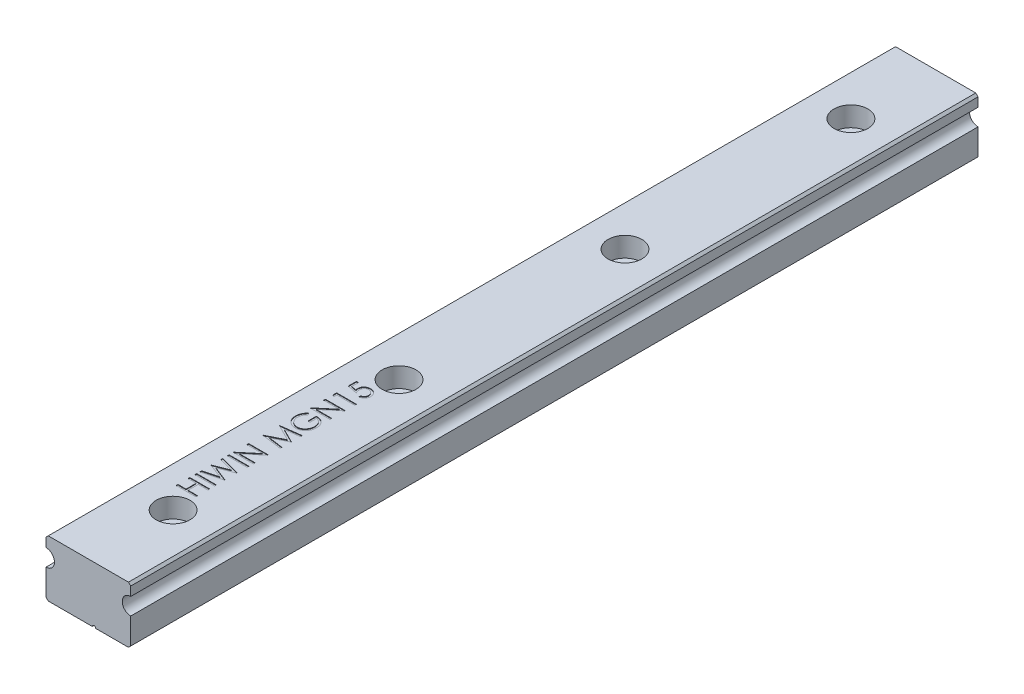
from build123d import *

# Parameters (mm, degrees)
EXTRUDE_1_DEPTH              = 150
HOLE_WIZARD_M3_1_D           = 3.5
HOLE_WIZARD_M3_1_CBORE_D     = 6
HOLE_WIZARD_M3_1_CBORE_DEPTH = 3.5
PATTERN_LINEAR_1_COUNT       = 4
PATTERN_LINEAR_1_PITCH       = 40
SKETCH_6_W                   = 3.5
SKETCH_6_H                   = 0.314102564
CUT_EXTRUDE_1_DEPTH          = 0.1


with BuildPart() as part:
    # Sketch 1 → Extrude 1 (new body)
    with BuildSketch(Plane.XY):
        with BuildLine():
            Line((-7.1, 0), (0.7, 0))
            ThreePointArc((0.7, 0), (1, 0.3), (1.3, 0))
            Line((1.3, 0), (7.1, 0))
            Line((7.1, 0), (7.5, 0.4))
            Line((7.5, 0.4), (7.5, 5))
            ThreePointArc((7.5, 5), (6, 6.5), (7.5, 8))
            Line((7.5, 8), (7.5, 9.6))
            Line((7.5, 9.6), (7.1, 10))
            Line((7.1, 10), (-7.1, 10))
            Line((-7.1, 10), (-7.5, 9.6))
            Line((-7.5, 9.6), (-7.5, 8))
            ThreePointArc((-7.5, 8), (-6, 6.5), (-7.5, 5))
            Line((-7.5, 5), (-7.5, 0.4))
            Line((-7.5, 0.4), (-7.1, 0))
        make_face()
    extrude(amount=-EXTRUDE_1_DEPTH)

    # Hole Wizard M3 _1 (through all)
    with Locations(Plane(origin=(-0.370542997, 10, 7.777563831), x_dir=(-1, 0, 0), z_dir=(0, 1, 0))):
        with Locations((-0.370542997, -22.777563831)):
            hole_wizard_m3_1 = CounterBoreHole(HOLE_WIZARD_M3_1_D / 2, HOLE_WIZARD_M3_1_CBORE_D / 2, HOLE_WIZARD_M3_1_CBORE_DEPTH)

    # Pattern Linear 1: Hole Wizard M3 _1 ×4
    with Locations(*[(0, 0, -i * PATTERN_LINEAR_1_PITCH) for i in range(1, PATTERN_LINEAR_1_COUNT)]):
        add(hole_wizard_m3_1, mode=Mode.SUBTRACT)

    # Sketch 6 → Cut-Extrude 1 (cut)
    with BuildSketch(Plane(origin=(0, 10, 0), x_dir=(1, 0, 0), z_dir=(0, 1, 0))):
        Polygon((-3.5, 19.048076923), (-3.5, 19.362179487), (-2.064102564, 19.362179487), (-2.064102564, 21.157051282), (-3.5, 21.157051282), (-3.5, 21.471153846), (0, 21.471153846), (0, 21.157051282), (-1.705128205, 21.157051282), (-1.705128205, 19.362179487), (0, 19.362179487), (0, 19.048076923), align=None)
        with Locations((-1.75, 22.525641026)):
            Rectangle(SKETCH_6_W, SKETCH_6_H)
        Polygon((-3.5, 23.221153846), (-3.5, 23.545773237), (-0.933193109, 24.230769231), (-3.5, 25.249499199), (-3.5, 25.295072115), (-0.950721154, 26.294871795), (-3.5, 26.983373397), (-3.5, 27.304487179), (0, 26.360777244), (0, 26.315905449), (-2.676883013, 25.262820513), (0, 24.197115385), (0, 24.15224359), align=None)
        with Locations((-1.75, 28.269230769)):
            Rectangle(SKETCH_6_W, SKETCH_6_H)
        Polygon((0, 29.189102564), (-3.5, 29.189102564), (-3.5, 29.255008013), (-0.745292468, 31.567307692), (-3.5, 31.567307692), (-3.5, 31.881410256), (0, 31.881410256), (0, 31.809895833), (-2.748397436, 29.503205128), (0, 29.503205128), align=None)
        Polygon((0, 33.945512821), (-3.5, 34.407552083), (-3.5, 34.452423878), (-0.628205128, 35.897435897), (-3.5, 37.338942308), (-3.5, 37.384515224), (0, 37.849358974), (0, 37.533854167), (-2.518429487, 37.198717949), (0, 35.935296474), (0, 35.864483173), (-2.524038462, 34.596153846), (0, 34.26171875), align=None)
        with BuildLine():
            Line((-2.902644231, 41.842948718), (-2.647435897, 41.573717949))
            add(Edge.make_bspline(
                [(-2.647435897, 41.573717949), (-2.69328212, 41.525008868), (-2.783881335, 41.428752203), (-2.901244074, 41.271552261), (-3.002777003, 41.108196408), (-3.084772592, 40.938420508), (-3.149094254, 40.766676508), (-3.195850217, 40.595917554), (-3.225460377, 40.427249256), (-3.229016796, 40.315084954), (-3.230769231, 40.259815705)],
                knots=[0, 0, 0, 0, 1.089067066, 2.152164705, 3.18986567, 4.218445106, 5.218487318, 6.173592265, 7.100032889, 8, 8, 8, 8], degree=3))
            add(Edge.make_bspline(
                [(-3.230769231, 40.259815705), (-3.230355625, 40.225901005), (-3.229529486, 40.158159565), (-3.218985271, 40.057537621), (-3.203820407, 39.957970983), (-3.181878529, 39.859647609), (-3.15406947, 39.762376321), (-3.119284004, 39.666495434), (-3.078728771, 39.571826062), (-3.031866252, 39.479260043), (-2.980386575, 39.38951931), (-2.923337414, 39.304763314), (-2.862550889, 39.224446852), (-2.796491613, 39.150097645), (-2.725807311, 39.081221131), (-2.651770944, 39.01655043), (-2.572926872, 38.957290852), (-2.489599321, 38.904505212), (-2.403726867, 38.856837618), (-2.316037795, 38.815645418), (-2.227346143, 38.779835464), (-2.136984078, 38.752561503), (-2.045883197, 38.729460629), (-1.953566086, 38.713379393), (-1.859791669, 38.704283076), (-1.796993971, 38.702712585), (-1.765424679, 38.701923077)],
                knots=[0, 0, 0, 0, 1.028150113, 2.053633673, 3.06513288, 4.081487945, 5.106702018, 6.131327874, 7.172780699, 8.228344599, 9.276313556, 10.308389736, 11.324843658, 12.329040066, 13.321460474, 14.316307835, 15.308626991, 16.309440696, 17.305625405, 18.28535951, 19.246194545, 20.203493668, 21.145557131, 22.095268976, 23.042464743, 24, 24, 24, 24], degree=3))
            add(Edge.make_bspline(
                [(-1.765424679, 38.701923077), (-1.733154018, 38.702679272), (-1.668700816, 38.704189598), (-1.572504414, 38.713842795), (-1.477747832, 38.731798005), (-1.384282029, 38.755609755), (-1.291920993, 38.78588243), (-1.20076111, 38.823074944), (-1.110811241, 38.867381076), (-1.022964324, 38.918552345), (-0.937464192, 38.975061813), (-0.856251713, 39.037212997), (-0.780271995, 39.105110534), (-0.708415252, 39.177509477), (-0.641134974, 39.255069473), (-0.579242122, 39.338543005), (-0.521779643, 39.426761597), (-0.469378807, 39.519764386), (-0.42257144, 39.616568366), (-0.38094723, 39.715824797), (-0.346667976, 39.817852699), (-0.31872985, 39.922115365), (-0.295829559, 40.028488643), (-0.281097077, 40.137512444), (-0.270406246, 40.248385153), (-0.269624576, 40.323123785), (-0.269230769, 40.360777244)],
                knots=[0, 0, 0, 0, 0.935915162, 1.869274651, 2.799799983, 3.730201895, 4.664668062, 5.616159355, 6.583070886, 7.570012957, 8.562524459, 9.553461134, 10.53281078, 11.515274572, 12.509912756, 13.507571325, 14.526460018, 15.561318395, 16.601025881, 17.643204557, 18.680545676, 19.719612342, 20.772381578, 21.833430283, 22.908478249, 24, 24, 24, 24], degree=3))
            add(Edge.make_bspline(
                [(-0.269230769, 40.360777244), (-0.270178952, 40.406155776), (-0.272040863, 40.495263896), (-0.286546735, 40.626247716), (-0.309173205, 40.752060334), (-0.342412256, 40.872292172), (-0.384484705, 40.987379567), (-0.436513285, 41.096898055), (-0.497950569, 41.201150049), (-0.567552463, 41.299684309), (-0.645100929, 41.39015833), (-0.728035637, 41.472500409), (-0.817431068, 41.543879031), (-0.911954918, 41.606426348), (-1.012511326, 41.658123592), (-1.118540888, 41.70056947), (-1.230109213, 41.733101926), (-1.307200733, 41.746457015), (-1.346153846, 41.753205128)],
                knots=[0, 0, 0, 0, 1.130199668, 2.219330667, 3.279027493, 4.311506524, 5.322739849, 6.327972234, 7.327472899, 8.33386792, 9.329086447, 10.29244429, 11.240784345, 12.174119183, 13.111530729, 14.052100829, 15.015757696, 16, 16, 16, 16], degree=3))
            Line((-1.346153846, 41.753205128), (-1.346153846, 40.586538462))
            Line((-1.346153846, 40.586538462), (-1.705128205, 40.586538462))
            Line((-1.705128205, 40.586538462), (-1.705128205, 42.067307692))
            add(Edge.make_bspline(
                [(-1.705128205, 42.067307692), (-1.638220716, 42.065601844), (-1.507270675, 42.062263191), (-1.316300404, 42.038844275), (-1.13592871, 42.001027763), (-0.965965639, 41.949367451), (-0.806652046, 41.88249217), (-0.65782618, 41.801119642), (-0.520449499, 41.703947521), (-0.393400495, 41.594437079), (-0.280071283, 41.471537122), (-0.180465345, 41.338568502), (-0.09656273, 41.195311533), (-0.028302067, 41.041901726), (0.024971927, 40.878841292), (0.062743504, 40.705752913), (0.085373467, 40.522871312), (0.088264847, 40.397534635), (0.08974359, 40.333433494)],
                knots=[0, 0, 0, 0, 1.140356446, 2.231883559, 3.274166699, 4.278491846, 5.25512956, 6.21435461, 7.1637429, 8.11826594, 9.068280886, 10.0076534, 10.945064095, 11.891975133, 12.864533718, 13.863980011, 14.907571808, 16, 16, 16, 16], degree=3))
            add(Edge.make_bspline(
                [(0.08974359, 40.333433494), (0.089174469, 40.293923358), (0.088051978, 40.215996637), (0.080074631, 40.100905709), (0.067794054, 39.988988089), (0.049248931, 39.88026008), (0.026534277, 39.774321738), (-0.002552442, 39.671702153), (-0.036221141, 39.572010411), (-0.074516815, 39.475092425), (-0.118888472, 39.381827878), (-0.168198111, 39.291801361), (-0.222191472, 39.204515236), (-0.281802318, 39.120564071), (-0.346584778, 39.039510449), (-0.416668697, 38.961877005), (-0.491839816, 38.887229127), (-0.545218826, 38.840468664), (-0.572115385, 38.816907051)],
                knots=[0, 0, 0, 0, 1.107784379, 2.184907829, 3.233506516, 4.263428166, 5.276301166, 6.270063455, 7.25232949, 8.225834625, 9.190232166, 10.146266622, 11.1027726, 12.066435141, 13.031522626, 14.010570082, 14.99756817, 16, 16, 16, 16], degree=3))
            add(Edge.make_bspline(
                [(-0.572115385, 38.816907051), (-0.614786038, 38.782721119), (-0.699419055, 38.714916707), (-0.835018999, 38.62763855), (-0.975420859, 38.553237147), (-1.121015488, 38.492869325), (-1.271666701, 38.445731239), (-1.427181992, 38.411924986), (-1.587761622, 38.392117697), (-1.696426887, 38.389264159), (-1.751402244, 38.387820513)],
                knots=[0, 0, 0, 0, 1.023165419, 2.029347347, 3.013907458, 3.994755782, 4.975994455, 5.96558838, 6.970761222, 8, 8, 8, 8], degree=3))
            add(Edge.make_bspline(
                [(-1.751402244, 38.387820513), (-1.792568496, 38.388352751), (-1.874377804, 38.389410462), (-1.99583511, 38.40223598), (-2.115135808, 38.420637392), (-2.232182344, 38.447684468), (-2.347053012, 38.481780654), (-2.45980069, 38.524334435), (-2.570493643, 38.573878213), (-2.67836343, 38.63146793), (-2.782003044, 38.695536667), (-2.880905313, 38.765144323), (-2.973467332, 38.840828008), (-3.059903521, 38.922808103), (-3.141494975, 39.009432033), (-3.216537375, 39.102518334), (-3.286205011, 39.20065667), (-3.349159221, 39.30460781), (-3.405727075, 39.412731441), (-3.455315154, 39.524792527), (-3.496298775, 39.640750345), (-3.531072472, 39.759737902), (-3.556787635, 39.882655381), (-3.575436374, 40.008610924), (-3.588196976, 40.138261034), (-3.589223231, 40.225897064), (-3.58974359, 40.270332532)],
                knots=[0, 0, 0, 0, 1.00895651, 2.005089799, 2.991467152, 3.967318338, 4.948153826, 5.927364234, 6.919980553, 7.91976625, 8.923240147, 9.905815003, 10.88314567, 11.851989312, 12.825009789, 13.798721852, 14.781296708, 15.773896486, 16.776076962, 17.771600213, 18.775744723, 19.78957137, 20.808953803, 21.851964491, 22.910847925, 24, 24, 24, 24], degree=3))
            add(Edge.make_bspline(
                [(-3.58974359, 40.270332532), (-3.589164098, 40.306570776), (-3.588015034, 40.378426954), (-3.580050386, 40.485352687), (-3.567426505, 40.590625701), (-3.550199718, 40.694402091), (-3.526736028, 40.796328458), (-3.498657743, 40.896695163), (-3.46596592, 40.995647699), (-3.426977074, 41.092875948), (-3.382723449, 41.189033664), (-3.332910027, 41.284655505), (-3.276685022, 41.379414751), (-3.213881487, 41.473475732), (-3.145578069, 41.56743159), (-3.069821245, 41.659796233), (-2.989598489, 41.752799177), (-2.931916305, 41.812600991), (-2.902644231, 41.842948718)],
                knots=[0, 0, 0, 0, 0.985871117, 1.954866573, 2.915460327, 3.869826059, 4.81536089, 5.759505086, 6.70452669, 7.649098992, 8.607881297, 9.583363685, 10.581137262, 11.603961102, 12.659522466, 13.73993555, 14.853081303, 16, 16, 16, 16], degree=3))
        make_face()
        Polygon((0, 42.78525641), (-3.5, 42.78525641), (-3.5, 42.851161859), (-0.745292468, 45.163461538), (-3.5, 45.163461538), (-3.5, 45.477564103), (0, 45.477564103), (0, 45.406049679), (-2.748397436, 43.099358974), (0, 43.099358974), align=None)
        Polygon((-3.5, 46.80478766), (-3.5, 47.451923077), (0, 47.451923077), (0, 47.137820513), (-3.141025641, 47.137820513), (-3.141025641, 46.599358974), align=None)
        with BuildLine():
            Line((-3.5, 50.951923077), (-3.141025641, 50.951923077))
            Line((-3.141025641, 50.951923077), (-3.141025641, 49.761418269))
            Line((-3.141025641, 49.761418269), (-2.220452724, 49.572816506))
            add(Edge.make_bspline(
                [(-2.220452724, 49.572816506), (-2.230682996, 49.609872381), (-2.25050253, 49.681662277), (-2.2725083, 49.787622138), (-2.285773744, 49.888214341), (-2.287585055, 49.953489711), (-2.288461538, 49.985076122)],
                knots=[0, 0, 0, 0, 1.100273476, 2.13160584, 3.095893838, 4, 4, 4, 4], degree=3))
            add(Edge.make_bspline(
                [(-2.288461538, 49.985076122), (-2.28764354, 50.024167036), (-2.28603515, 50.10102954), (-2.269673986, 50.213313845), (-2.245976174, 50.321041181), (-2.209465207, 50.422620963), (-2.164878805, 50.519660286), (-2.108721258, 50.610492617), (-2.04315746, 50.696392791), (-1.968525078, 50.77676711), (-1.885534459, 50.849340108), (-1.795933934, 50.912403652), (-1.701678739, 50.967446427), (-1.600559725, 51.010374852), (-1.494484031, 51.045408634), (-1.382227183, 51.068509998), (-1.264785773, 51.083940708), (-1.18448027, 51.085661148), (-1.143529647, 51.086538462)],
                knots=[0, 0, 0, 0, 1.052805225, 2.070078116, 3.052532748, 4.020689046, 4.973125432, 5.925915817, 6.89216474, 7.881560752, 8.877013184, 9.857446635, 10.830895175, 11.812622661, 12.812548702, 13.836681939, 14.896847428, 16, 16, 16, 16], degree=3))
            add(Edge.make_bspline(
                [(-1.143529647, 51.086538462), (-1.115007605, 51.085872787), (-1.058348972, 51.084550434), (-0.974202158, 51.07784063), (-0.891849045, 51.064872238), (-0.811440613, 51.047672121), (-0.732901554, 51.024710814), (-0.65579213, 50.997853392), (-0.580956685, 50.964471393), (-0.508064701, 50.927463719), (-0.437950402, 50.886484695), (-0.372294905, 50.840404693), (-0.309599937, 50.792524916), (-0.251727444, 50.74020742), (-0.198452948, 50.684047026), (-0.149513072, 50.624356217), (-0.104029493, 50.561676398), (-0.063861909, 50.495020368), (-0.026898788, 50.425878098), (0.003424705, 50.353249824), (0.030535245, 50.278789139), (0.05214477, 50.201424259), (0.069077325, 50.121330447), (0.080577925, 50.038375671), (0.088954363, 49.952995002), (0.08947872, 49.895119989), (0.08974359, 49.865885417)],
                knots=[0, 0, 0, 0, 1.056393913, 2.098511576, 3.122979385, 4.141471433, 5.141222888, 6.151259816, 7.162667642, 8.172852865, 9.177685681, 10.166741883, 11.141342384, 12.097242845, 13.052202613, 14.005160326, 14.953864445, 15.917140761, 16.884916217, 17.854238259, 18.828761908, 19.81781811, 20.826036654, 21.857789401, 22.917898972, 24, 24, 24, 24], degree=3))
            add(Edge.make_bspline(
                [(0.08974359, 49.865885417), (0.089050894, 49.831012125), (0.087688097, 49.762403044), (0.073496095, 49.661869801), (0.053035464, 49.565201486), (0.022721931, 49.472812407), (-0.016971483, 49.385087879), (-0.064133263, 49.300771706), (-0.12027864, 49.220908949), (-0.184894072, 49.146045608), (-0.255892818, 49.077229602), (-0.332202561, 49.014826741), (-0.413920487, 48.959963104), (-0.500780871, 48.912439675), (-0.592629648, 48.871954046), (-0.689749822, 48.840135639), (-0.791650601, 48.814458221), (-0.861804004, 48.803594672), (-0.897435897, 48.798076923)],
                knots=[0, 0, 0, 0, 1.046872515, 2.059598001, 3.044168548, 4.012104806, 4.973680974, 5.932408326, 6.910122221, 7.900780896, 8.89867654, 9.876692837, 10.858029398, 11.85084981, 12.847361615, 13.868568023, 14.917415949, 16, 16, 16, 16], degree=3))
            Line((-0.897435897, 48.798076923), (-0.897435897, 49.112179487))
            add(Edge.make_bspline(
                [(-0.897435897, 49.112179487), (-0.86405597, 49.11990321), (-0.799897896, 49.134748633), (-0.709812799, 49.167418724), (-0.62950762, 49.20697569), (-0.558491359, 49.255109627), (-0.495464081, 49.310903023), (-0.43989307, 49.375759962), (-0.389697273, 49.448059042), (-0.347784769, 49.52844142), (-0.312479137, 49.613409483), (-0.287283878, 49.701832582), (-0.272032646, 49.792438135), (-0.270168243, 49.853440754), (-0.269230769, 49.884114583)],
                knots=[0, 0, 0, 0, 1.13623081, 2.183898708, 3.172478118, 4.09966615, 5.022692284, 5.957376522, 6.927682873, 7.937366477, 8.960015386, 9.976409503, 10.982481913, 12, 12, 12, 12], degree=3))
            add(Edge.make_bspline(
                [(-0.269230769, 49.884114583), (-0.270058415, 49.914070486), (-0.271688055, 49.973053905), (-0.284028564, 50.059901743), (-0.303533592, 50.143504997), (-0.33085902, 50.224012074), (-0.367008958, 50.301027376), (-0.411417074, 50.374442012), (-0.462975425, 50.445301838), (-0.521904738, 50.511741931), (-0.586881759, 50.572578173), (-0.656357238, 50.626335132), (-0.730474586, 50.671111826), (-0.807947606, 50.708845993), (-0.889626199, 50.737499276), (-0.975127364, 50.757940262), (-1.064662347, 50.76994332), (-1.125731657, 50.7715945), (-1.156850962, 50.772435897)],
                knots=[0, 0, 0, 0, 1.027268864, 2.022700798, 3.002744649, 3.968653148, 4.933396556, 5.915045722, 6.907600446, 7.935526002, 8.956456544, 9.95700807, 10.942805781, 11.92166854, 12.907987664, 13.905483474, 14.932689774, 16, 16, 16, 16], degree=3))
            add(Edge.make_bspline(
                [(-1.156850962, 50.772435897), (-1.184930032, 50.771797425), (-1.239659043, 50.770552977), (-1.320009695, 50.759779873), (-1.396158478, 50.741783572), (-1.468436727, 50.716160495), (-1.536613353, 50.684182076), (-1.600538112, 50.644032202), (-1.660812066, 50.597420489), (-1.715884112, 50.54300237), (-1.766793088, 50.483806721), (-1.810034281, 50.418313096), (-1.846807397, 50.348269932), (-1.876936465, 50.273547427), (-1.900936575, 50.194053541), (-1.917523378, 50.109745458), (-1.92744867, 50.020603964), (-1.928795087, 49.95962832), (-1.929487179, 49.928285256)],
                knots=[0, 0, 0, 0, 1.045723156, 2.038222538, 3.013889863, 3.95567481, 4.890389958, 5.81331128, 6.76251276, 7.723027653, 8.692928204, 9.666105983, 10.639751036, 11.635719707, 12.66315958, 13.728667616, 14.832476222, 16, 16, 16, 16], degree=3))
            add(Edge.make_bspline(
                [(-1.929487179, 49.928285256), (-1.928906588, 49.901156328), (-1.927707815, 49.845141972), (-1.918881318, 49.759219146), (-1.904642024, 49.668927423), (-1.885055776, 49.574612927), (-1.859424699, 49.475992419), (-1.828710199, 49.373274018), (-1.7919882, 49.266241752), (-1.764255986, 49.194124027), (-1.75, 49.157051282)],
                knots=[0, 0, 0, 0, 0.817624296, 1.688186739, 2.600797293, 3.572016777, 4.590301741, 5.671205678, 6.80286297, 8, 8, 8, 8], degree=3))
            Line((-1.75, 49.157051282), (-3.5, 49.516025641))
            Line((-3.5, 49.516025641), (-3.5, 50.951923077))
        make_face()
    extrude(amount=-CUT_EXTRUDE_1_DEPTH, mode=Mode.SUBTRACT)


solid = part.part
